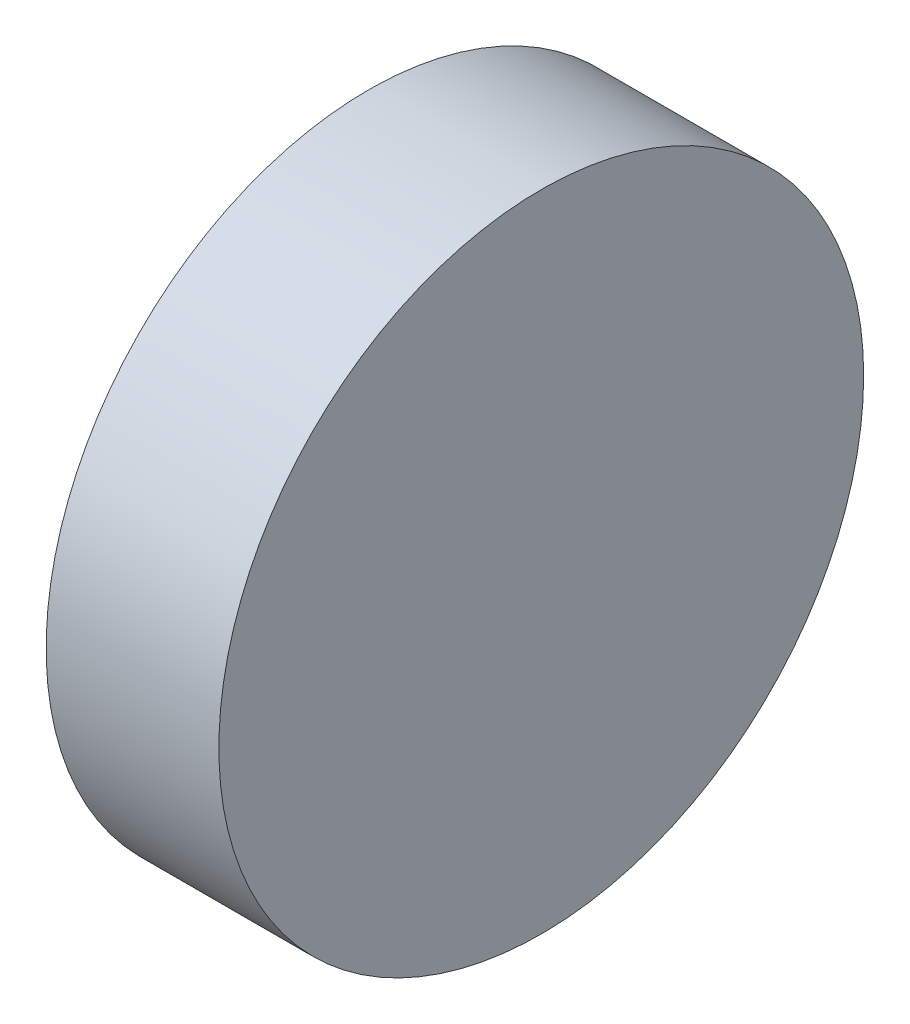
ISO-10303-21;
HEADER;
FILE_DESCRIPTION(('STEP AP214'),'2;1');
FILE_NAME('part.step','',(''),(''),'','','');
FILE_SCHEMA(('AUTOMOTIVE_DESIGN { 1 0 10303 214 1 1 1 1 }'));
ENDSEC;
DATA;
#1=APPLICATION_CONTEXT('core data for automotive mechanical design processes');
#2=APPLICATION_PROTOCOL_DEFINITION('international standard','automotive_design',2000,#1);
#3=PRODUCT_CONTEXT('',#1,'mechanical');
#4=PRODUCT('Part','Part','',(#3));
#5=PRODUCT_RELATED_PRODUCT_CATEGORY('part','',(#4));
#6=PRODUCT_DEFINITION_FORMATION('','',#4);
#7=PRODUCT_DEFINITION_CONTEXT('part definition',#1,'design');
#8=PRODUCT_DEFINITION('design','',#6,#7);
#9=PRODUCT_DEFINITION_SHAPE('','',#8);
#10=(LENGTH_UNIT() NAMED_UNIT(*) SI_UNIT(.MILLI.,.METRE.));
#11=(NAMED_UNIT(*) PLANE_ANGLE_UNIT() SI_UNIT($,.RADIAN.));
#12=(NAMED_UNIT(*) SI_UNIT($,.STERADIAN.) SOLID_ANGLE_UNIT());
#13=UNCERTAINTY_MEASURE_WITH_UNIT(LENGTH_MEASURE(1.E-05),#10,'distance_accuracy_value','');
#14=(GEOMETRIC_REPRESENTATION_CONTEXT(3) GLOBAL_UNCERTAINTY_ASSIGNED_CONTEXT((#13)) GLOBAL_UNIT_ASSIGNED_CONTEXT((#10,
#11,#12)) REPRESENTATION_CONTEXT('',''));
#15=CARTESIAN_POINT('',(0.,0.,0.));
#16=DIRECTION('',(0.,0.,1.));
#17=DIRECTION('',(1.,0.,0.));
#18=AXIS2_PLACEMENT_3D('',#15,#16,#17);
#19=CARTESIAN_POINT('',(10.73,0.,4.8));
#20=DIRECTION('',(1.,0.,0.));
#21=DIRECTION('',(0.,0.,-1.));
#22=AXIS2_PLACEMENT_3D('',#19,#20,#21);
#23=PLANE('',#22);
#24=CARTESIAN_POINT('',(10.73,0.,4.8));
#25=DIRECTION('',(1.,0.,0.));
#26=DIRECTION('',(0.,0.,-1.));
#27=AXIS2_PLACEMENT_3D('',#24,#25,#26);
#28=CIRCLE('',#27,2.799999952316);
#29=CARTESIAN_POINT('',(10.73,0.,2.000000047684));
#30=VERTEX_POINT('',#29);
#31=EDGE_CURVE('E17',#30,#30,#28,.F.);
#32=ORIENTED_EDGE('',*,*,#31,.F.);
#33=EDGE_LOOP('',(#32));
#34=FACE_BOUND('',#33,.T.);
#35=ADVANCED_FACE('F14',(#34),#23,.T.);
#36=CARTESIAN_POINT('',(9.23,0.,4.8));
#37=DIRECTION('',(1.,0.,0.));
#38=DIRECTION('',(0.,0.,-1.));
#39=AXIS2_PLACEMENT_3D('',#36,#37,#38);
#40=PLANE('',#39);
#41=CARTESIAN_POINT('',(9.23,0.,4.8));
#42=DIRECTION('',(1.,0.,0.));
#43=DIRECTION('',(0.,0.,-1.));
#44=AXIS2_PLACEMENT_3D('',#41,#42,#43);
#45=CIRCLE('',#44,2.799999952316);
#46=CARTESIAN_POINT('',(9.23,0.,2.000000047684));
#47=VERTEX_POINT('',#46);
#48=EDGE_CURVE('E10',#47,#47,#45,.T.);
#49=ORIENTED_EDGE('',*,*,#48,.F.);
#50=EDGE_LOOP('',(#49));
#51=FACE_BOUND('',#50,.T.);
#52=ADVANCED_FACE('F29',(#51),#40,.F.);
#53=CARTESIAN_POINT('',(9.23,0.,4.8));
#54=DIRECTION('',(1.,0.,0.));
#55=DIRECTION('',(0.,0.,-1.));
#56=AXIS2_PLACEMENT_3D('',#53,#54,#55);
#57=CYLINDRICAL_SURFACE('',#56,2.799999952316);
#58=ORIENTED_EDGE('',*,*,#48,.T.);
#59=EDGE_LOOP('',(#58));
#60=FACE_BOUND('',#59,.T.);
#61=ORIENTED_EDGE('',*,*,#31,.T.);
#62=EDGE_LOOP('',(#61));
#63=FACE_BOUND('',#62,.T.);
#64=ADVANCED_FACE('F26',(#60,#63),#57,.T.);
#65=CLOSED_SHELL('',(#35,#52,#64));
#66=MANIFOLD_SOLID_BREP('B1',#65);
#67=ADVANCED_BREP_SHAPE_REPRESENTATION('',(#18,#66),#14);
#68=SHAPE_DEFINITION_REPRESENTATION(#9,#67);
ENDSEC;
END-ISO-10303-21;
